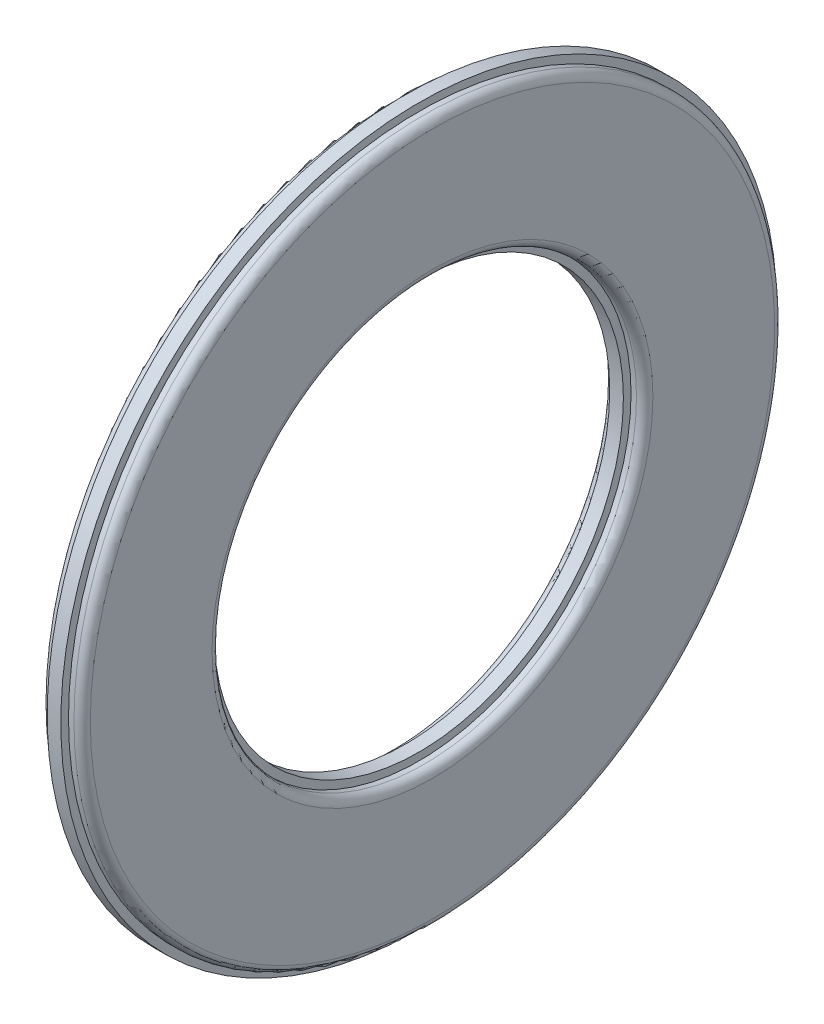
ISO-10303-21;
HEADER;
FILE_DESCRIPTION(('STEP AP214'),'2;1');
FILE_NAME('part.step','',(''),(''),'','','');
FILE_SCHEMA(('AUTOMOTIVE_DESIGN { 1 0 10303 214 1 1 1 1 }'));
ENDSEC;
DATA;
#1=APPLICATION_CONTEXT('core data for automotive mechanical design processes');
#2=APPLICATION_PROTOCOL_DEFINITION('international standard','automotive_design',2000,#1);
#3=PRODUCT_CONTEXT('',#1,'mechanical');
#4=PRODUCT('Part','Part','',(#3));
#5=PRODUCT_RELATED_PRODUCT_CATEGORY('part','',(#4));
#6=PRODUCT_DEFINITION_FORMATION('','',#4);
#7=PRODUCT_DEFINITION_CONTEXT('part definition',#1,'design');
#8=PRODUCT_DEFINITION('design','',#6,#7);
#9=PRODUCT_DEFINITION_SHAPE('','',#8);
#10=(LENGTH_UNIT() NAMED_UNIT(*) SI_UNIT(.MILLI.,.METRE.));
#11=(NAMED_UNIT(*) PLANE_ANGLE_UNIT() SI_UNIT($,.RADIAN.));
#12=(NAMED_UNIT(*) SI_UNIT($,.STERADIAN.) SOLID_ANGLE_UNIT());
#13=UNCERTAINTY_MEASURE_WITH_UNIT(LENGTH_MEASURE(1.E-05),#10,'distance_accuracy_value','');
#14=(GEOMETRIC_REPRESENTATION_CONTEXT(3) GLOBAL_UNCERTAINTY_ASSIGNED_CONTEXT((#13)) GLOBAL_UNIT_ASSIGNED_CONTEXT((#10,
#11,#12)) REPRESENTATION_CONTEXT('',''));
#15=CARTESIAN_POINT('',(0.,0.,0.));
#16=DIRECTION('',(0.,0.,1.));
#17=DIRECTION('',(1.,0.,0.));
#18=AXIS2_PLACEMENT_3D('',#15,#16,#17);
#19=CARTESIAN_POINT('',(-0.333333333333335,17.5,0.));
#20=DIRECTION('',(-1.,0.,0.));
#21=DIRECTION('',(0.,0.,1.));
#22=AXIS2_PLACEMENT_3D('',#19,#20,#21);
#23=PLANE('',#22);
#24=CARTESIAN_POINT('',(-0.333333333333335,0.,0.));
#25=DIRECTION('',(-1.,0.,0.));
#26=DIRECTION('',(0.,0.,1.));
#27=AXIS2_PLACEMENT_3D('',#24,#25,#26);
#28=CIRCLE('',#27,10.375);
#29=CARTESIAN_POINT('',(-0.333333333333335,0.,10.375));
#30=VERTEX_POINT('',#29);
#31=EDGE_CURVE('E67',#30,#30,#28,.T.);
#32=ORIENTED_EDGE('',*,*,#31,.T.);
#33=EDGE_LOOP('',(#32));
#34=FACE_BOUND('',#33,.T.);
#35=CARTESIAN_POINT('',(-0.333333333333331,0.,0.));
#36=DIRECTION('',(1.,0.,0.));
#37=DIRECTION('',(0.,0.,-1.));
#38=AXIS2_PLACEMENT_3D('',#35,#36,#37);
#39=CIRCLE('',#38,10.);
#40=CARTESIAN_POINT('',(-0.333333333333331,0.,-10.));
#41=VERTEX_POINT('',#40);
#42=EDGE_CURVE('E10',#41,#41,#39,.T.);
#43=ORIENTED_EDGE('',*,*,#42,.T.);
#44=EDGE_LOOP('',(#43));
#45=FACE_BOUND('',#44,.T.);
#46=ADVANCED_FACE('F33',(#34,#45),#23,.T.);
#47=CARTESIAN_POINT('',(0.333333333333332,17.5,0.));
#48=DIRECTION('',(1.,0.,0.));
#49=DIRECTION('',(0.,0.,-1.));
#50=AXIS2_PLACEMENT_3D('',#47,#48,#49);
#51=PLANE('',#50);
#52=CARTESIAN_POINT('',(0.333333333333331,0.,0.));
#53=DIRECTION('',(1.,0.,0.));
#54=DIRECTION('',(0.,0.,-1.));
#55=AXIS2_PLACEMENT_3D('',#52,#53,#54);
#56=CIRCLE('',#55,10.375);
#57=CARTESIAN_POINT('',(0.333333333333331,0.,-10.375));
#58=VERTEX_POINT('',#57);
#59=EDGE_CURVE('E37',#58,#58,#56,.T.);
#60=ORIENTED_EDGE('',*,*,#59,.T.);
#61=EDGE_LOOP('',(#60));
#62=FACE_BOUND('',#61,.T.);
#63=CARTESIAN_POINT('',(0.333333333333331,0.,0.));
#64=DIRECTION('',(1.,0.,0.));
#65=DIRECTION('',(0.,0.,-1.));
#66=AXIS2_PLACEMENT_3D('',#63,#64,#65);
#67=CIRCLE('',#66,10.);
#68=CARTESIAN_POINT('',(0.333333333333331,0.,-10.));
#69=VERTEX_POINT('',#68);
#70=EDGE_CURVE('E41',#69,#69,#67,.T.);
#71=ORIENTED_EDGE('',*,*,#70,.F.);
#72=EDGE_LOOP('',(#71));
#73=FACE_BOUND('',#72,.T.);
#74=ADVANCED_FACE('F86',(#62,#73),#51,.T.);
#75=CARTESIAN_POINT('',(-34.925,0.,0.));
#76=DIRECTION('',(1.,0.,0.));
#77=DIRECTION('',(0.,0.,-1.));
#78=AXIS2_PLACEMENT_3D('',#75,#76,#77);
#79=CYLINDRICAL_SURFACE('',#78,10.);
#80=ORIENTED_EDGE('',*,*,#70,.T.);
#81=EDGE_LOOP('',(#80));
#82=FACE_BOUND('',#81,.T.);
#83=ORIENTED_EDGE('',*,*,#42,.F.);
#84=EDGE_LOOP('',(#83));
#85=FACE_BOUND('',#84,.T.);
#86=ADVANCED_FACE('F95',(#82,#85),#79,.F.);
#87=CARTESIAN_POINT('',(0.599999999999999,0.,0.));
#88=DIRECTION('',(-1.,0.,0.));
#89=DIRECTION('',(0.,0.,1.));
#90=AXIS2_PLACEMENT_3D('',#87,#88,#89);
#91=TOROIDAL_SURFACE('',#90,10.775,0.399999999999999);
#92=CARTESIAN_POINT('',(0.999999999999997,0.,0.));
#93=DIRECTION('',(-1.,0.,0.));
#94=DIRECTION('',(0.,0.,1.));
#95=AXIS2_PLACEMENT_3D('',#92,#93,#94);
#96=CIRCLE('',#95,10.775);
#97=CARTESIAN_POINT('',(0.999999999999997,0.,10.775));
#98=VERTEX_POINT('',#97);
#99=EDGE_CURVE('E63',#98,#98,#96,.T.);
#100=ORIENTED_EDGE('',*,*,#99,.F.);
#101=EDGE_LOOP('',(#100));
#102=FACE_BOUND('',#101,.T.);
#103=CARTESIAN_POINT('',(0.6,0.,0.));
#104=DIRECTION('',(-1.,0.,0.));
#105=DIRECTION('',(0.,0.,1.));
#106=AXIS2_PLACEMENT_3D('',#103,#104,#105);
#107=CIRCLE('',#106,10.375);
#108=CARTESIAN_POINT('',(0.6,0.,10.375));
#109=VERTEX_POINT('',#108);
#110=EDGE_CURVE('E58',#109,#109,#107,.T.);
#111=ORIENTED_EDGE('',*,*,#110,.T.);
#112=EDGE_LOOP('',(#111));
#113=FACE_BOUND('',#112,.T.);
#114=ADVANCED_FACE('F117',(#102,#113),#91,.T.);
#115=CARTESIAN_POINT('',(-17.78,0.,0.));
#116=DIRECTION('',(-1.,0.,0.));
#117=DIRECTION('',(0.,0.,1.));
#118=AXIS2_PLACEMENT_3D('',#115,#116,#117);
#119=CYLINDRICAL_SURFACE('',#118,10.375);
#120=ORIENTED_EDGE('',*,*,#59,.F.);
#121=EDGE_LOOP('',(#120));
#122=FACE_BOUND('',#121,.T.);
#123=ORIENTED_EDGE('',*,*,#110,.F.);
#124=EDGE_LOOP('',(#123));
#125=FACE_BOUND('',#124,.T.);
#126=ADVANCED_FACE('F104',(#122,#125),#119,.F.);
#127=CARTESIAN_POINT('',(1.,16.725,0.));
#128=DIRECTION('',(-1.,0.,0.));
#129=DIRECTION('',(0.,0.,1.));
#130=AXIS2_PLACEMENT_3D('',#127,#128,#129);
#131=PLANE('',#130);
#132=CARTESIAN_POINT('',(1.,0.,0.));
#133=DIRECTION('',(-1.,0.,0.));
#134=DIRECTION('',(0.,0.,1.));
#135=AXIS2_PLACEMENT_3D('',#132,#133,#134);
#136=CIRCLE('',#135,16.725);
#137=CARTESIAN_POINT('',(1.,0.,16.725));
#138=VERTEX_POINT('',#137);
#139=EDGE_CURVE('E252',#138,#138,#136,.T.);
#140=ORIENTED_EDGE('',*,*,#139,.F.);
#141=EDGE_LOOP('',(#140));
#142=FACE_BOUND('',#141,.T.);
#143=ORIENTED_EDGE('',*,*,#99,.T.);
#144=EDGE_LOOP('',(#143));
#145=FACE_BOUND('',#144,.T.);
#146=ADVANCED_FACE('F116',(#142,#145),#131,.F.);
#147=CARTESIAN_POINT('',(0.599999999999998,0.,0.));
#148=DIRECTION('',(-1.,0.,0.));
#149=DIRECTION('',(0.,0.,1.));
#150=AXIS2_PLACEMENT_3D('',#147,#148,#149);
#151=TOROIDAL_SURFACE('',#150,16.725,0.400000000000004);
#152=CARTESIAN_POINT('',(0.599999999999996,0.,0.));
#153=DIRECTION('',(-1.,0.,0.));
#154=DIRECTION('',(0.,0.,1.));
#155=AXIS2_PLACEMENT_3D('',#152,#153,#154);
#156=CIRCLE('',#155,17.125);
#157=CARTESIAN_POINT('',(0.599999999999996,0.,17.125));
#158=VERTEX_POINT('',#157);
#159=EDGE_CURVE('E246',#158,#158,#156,.T.);
#160=ORIENTED_EDGE('',*,*,#159,.F.);
#161=EDGE_LOOP('',(#160));
#162=FACE_BOUND('',#161,.T.);
#163=ORIENTED_EDGE('',*,*,#139,.T.);
#164=EDGE_LOOP('',(#163));
#165=FACE_BOUND('',#164,.T.);
#166=ADVANCED_FACE('F112',(#162,#165),#151,.T.);
#167=CARTESIAN_POINT('',(-17.78,0.,0.));
#168=DIRECTION('',(-1.,0.,0.));
#169=DIRECTION('',(0.,0.,1.));
#170=AXIS2_PLACEMENT_3D('',#167,#168,#169);
#171=CYLINDRICAL_SURFACE('',#170,17.125);
#172=CARTESIAN_POINT('',(0.333333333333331,0.,0.));
#173=DIRECTION('',(1.,0.,0.));
#174=DIRECTION('',(0.,0.,-1.));
#175=AXIS2_PLACEMENT_3D('',#172,#173,#174);
#176=CIRCLE('',#175,17.125);
#177=CARTESIAN_POINT('',(0.333333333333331,0.,-17.125));
#178=VERTEX_POINT('',#177);
#179=EDGE_CURVE('E49',#178,#178,#176,.F.);
#180=ORIENTED_EDGE('',*,*,#179,.F.);
#181=EDGE_LOOP('',(#180));
#182=FACE_BOUND('',#181,.T.);
#183=ORIENTED_EDGE('',*,*,#159,.T.);
#184=EDGE_LOOP('',(#183));
#185=FACE_BOUND('',#184,.T.);
#186=ADVANCED_FACE('F102',(#182,#185),#171,.T.);
#187=ORIENTED_EDGE('',*,*,#31,.F.);
#188=EDGE_LOOP('',(#187));
#189=FACE_BOUND('',#188,.T.);
#190=CARTESIAN_POINT('',(-0.6,0.,0.));
#191=DIRECTION('',(-1.,0.,0.));
#192=DIRECTION('',(0.,0.,1.));
#193=AXIS2_PLACEMENT_3D('',#190,#191,#192);
#194=CIRCLE('',#193,10.375);
#195=CARTESIAN_POINT('',(-0.6,0.,10.375));
#196=VERTEX_POINT('',#195);
#197=EDGE_CURVE('E52',#196,#196,#194,.T.);
#198=ORIENTED_EDGE('',*,*,#197,.T.);
#199=EDGE_LOOP('',(#198));
#200=FACE_BOUND('',#199,.T.);
#201=ADVANCED_FACE('F99',(#189,#200),#119,.F.);
#202=CARTESIAN_POINT('',(-0.333333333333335,0.,0.));
#203=DIRECTION('',(-1.,0.,0.));
#204=DIRECTION('',(0.,0.,1.));
#205=AXIS2_PLACEMENT_3D('',#202,#203,#204);
#206=CIRCLE('',#205,17.125);
#207=CARTESIAN_POINT('',(-0.333333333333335,0.,17.125));
#208=VERTEX_POINT('',#207);
#209=EDGE_CURVE('E51',#208,#208,#206,.F.);
#210=ORIENTED_EDGE('',*,*,#209,.F.);
#211=EDGE_LOOP('',(#210));
#212=FACE_BOUND('',#211,.T.);
#213=CARTESIAN_POINT('',(-0.600000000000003,0.,0.));
#214=DIRECTION('',(-1.,0.,0.));
#215=DIRECTION('',(0.,0.,1.));
#216=AXIS2_PLACEMENT_3D('',#213,#214,#215);
#217=CIRCLE('',#216,17.125);
#218=CARTESIAN_POINT('',(-0.600000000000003,0.,17.125));
#219=VERTEX_POINT('',#218);
#220=EDGE_CURVE('E243',#219,#219,#217,.T.);
#221=ORIENTED_EDGE('',*,*,#220,.F.);
#222=EDGE_LOOP('',(#221));
#223=FACE_BOUND('',#222,.T.);
#224=ADVANCED_FACE('F101',(#212,#223),#171,.T.);
#225=CARTESIAN_POINT('',(-0.600000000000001,0.,0.));
#226=DIRECTION('',(-1.,0.,0.));
#227=DIRECTION('',(0.,0.,1.));
#228=AXIS2_PLACEMENT_3D('',#225,#226,#227);
#229=TOROIDAL_SURFACE('',#228,10.775,0.399999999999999);
#230=ORIENTED_EDGE('',*,*,#197,.F.);
#231=EDGE_LOOP('',(#230));
#232=FACE_BOUND('',#231,.T.);
#233=CARTESIAN_POINT('',(-1.,0.,0.));
#234=DIRECTION('',(-1.,0.,0.));
#235=DIRECTION('',(0.,0.,1.));
#236=AXIS2_PLACEMENT_3D('',#233,#234,#235);
#237=CIRCLE('',#236,10.775);
#238=CARTESIAN_POINT('',(-1.,0.,10.775));
#239=VERTEX_POINT('',#238);
#240=EDGE_CURVE('E239',#239,#239,#237,.T.);
#241=ORIENTED_EDGE('',*,*,#240,.T.);
#242=EDGE_LOOP('',(#241));
#243=FACE_BOUND('',#242,.T.);
#244=ADVANCED_FACE('F109',(#232,#243),#229,.T.);
#245=CARTESIAN_POINT('',(-0.600000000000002,0.,0.));
#246=DIRECTION('',(-1.,0.,0.));
#247=DIRECTION('',(0.,0.,1.));
#248=AXIS2_PLACEMENT_3D('',#245,#246,#247);
#249=TOROIDAL_SURFACE('',#248,16.725,0.400000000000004);
#250=CARTESIAN_POINT('',(-1.,0.,0.));
#251=DIRECTION('',(-1.,0.,0.));
#252=DIRECTION('',(0.,0.,1.));
#253=AXIS2_PLACEMENT_3D('',#250,#251,#252);
#254=CIRCLE('',#253,16.725);
#255=CARTESIAN_POINT('',(-1.,0.,16.725));
#256=VERTEX_POINT('',#255);
#257=EDGE_CURVE('E242',#256,#256,#254,.T.);
#258=ORIENTED_EDGE('',*,*,#257,.F.);
#259=EDGE_LOOP('',(#258));
#260=FACE_BOUND('',#259,.T.);
#261=ORIENTED_EDGE('',*,*,#220,.T.);
#262=EDGE_LOOP('',(#261));
#263=FACE_BOUND('',#262,.T.);
#264=ADVANCED_FACE('F191',(#260,#263),#249,.T.);
#265=CARTESIAN_POINT('',(-1.,16.725,0.));
#266=DIRECTION('',(1.,0.,0.));
#267=DIRECTION('',(0.,0.,-1.));
#268=AXIS2_PLACEMENT_3D('',#265,#266,#267);
#269=PLANE('',#268);
#270=ORIENTED_EDGE('',*,*,#240,.F.);
#271=EDGE_LOOP('',(#270));
#272=FACE_BOUND('',#271,.T.);
#273=ORIENTED_EDGE('',*,*,#257,.T.);
#274=EDGE_LOOP('',(#273));
#275=FACE_BOUND('',#274,.T.);
#276=ADVANCED_FACE('F87',(#272,#275),#269,.F.);
#277=ORIENTED_EDGE('',*,*,#209,.T.);
#278=EDGE_LOOP('',(#277));
#279=FACE_BOUND('',#278,.T.);
#280=CARTESIAN_POINT('',(-0.333333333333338,0.,0.));
#281=DIRECTION('',(1.,0.,0.));
#282=DIRECTION('',(0.,0.,-1.));
#283=AXIS2_PLACEMENT_3D('',#280,#281,#282);
#284=CIRCLE('',#283,17.5);
#285=CARTESIAN_POINT('',(-0.333333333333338,0.,-17.5));
#286=VERTEX_POINT('',#285);
#287=EDGE_CURVE('E70',#286,#286,#284,.T.);
#288=ORIENTED_EDGE('',*,*,#287,.F.);
#289=EDGE_LOOP('',(#288));
#290=FACE_BOUND('',#289,.T.);
#291=ADVANCED_FACE('F35',(#279,#290),#23,.T.);
#292=CARTESIAN_POINT('',(-34.925,0.,0.));
#293=DIRECTION('',(1.,0.,0.));
#294=DIRECTION('',(0.,0.,-1.));
#295=AXIS2_PLACEMENT_3D('',#292,#293,#294);
#296=CYLINDRICAL_SURFACE('',#295,17.5);
#297=ORIENTED_EDGE('',*,*,#287,.T.);
#298=EDGE_LOOP('',(#297));
#299=FACE_BOUND('',#298,.T.);
#300=CARTESIAN_POINT('',(0.333333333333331,0.,0.));
#301=DIRECTION('',(1.,0.,0.));
#302=DIRECTION('',(0.,0.,-1.));
#303=AXIS2_PLACEMENT_3D('',#300,#301,#302);
#304=CIRCLE('',#303,17.5);
#305=CARTESIAN_POINT('',(0.333333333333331,0.,-17.5));
#306=VERTEX_POINT('',#305);
#307=EDGE_CURVE('E46',#306,#306,#304,.T.);
#308=ORIENTED_EDGE('',*,*,#307,.F.);
#309=EDGE_LOOP('',(#308));
#310=FACE_BOUND('',#309,.T.);
#311=ADVANCED_FACE('F77',(#299,#310),#296,.T.);
#312=ORIENTED_EDGE('',*,*,#179,.T.);
#313=EDGE_LOOP('',(#312));
#314=FACE_BOUND('',#313,.T.);
#315=ORIENTED_EDGE('',*,*,#307,.T.);
#316=EDGE_LOOP('',(#315));
#317=FACE_BOUND('',#316,.T.);
#318=ADVANCED_FACE('F75',(#314,#317),#51,.T.);
#319=CLOSED_SHELL('',(#46,#74,#86,#114,#126,#146,#166,#186,#201,#224,#244,#264,#276,#291,#311,#318));
#320=MANIFOLD_SOLID_BREP('B2',#319);
#321=ADVANCED_BREP_SHAPE_REPRESENTATION('',(#18,#320),#14);
#322=SHAPE_DEFINITION_REPRESENTATION(#9,#321);
ENDSEC;
END-ISO-10303-21;
